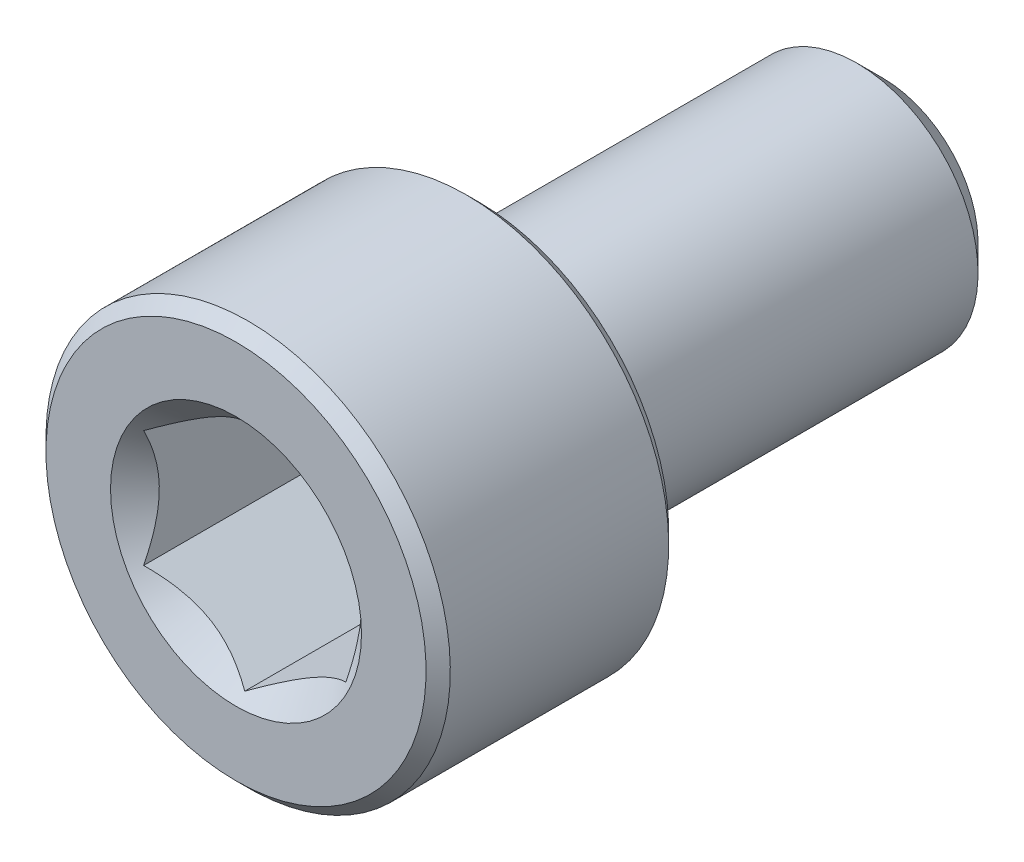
from build123d import *

# Parameters (mm, degrees)
CUT_EXTRUDE1_DEPTH = 5
SKETCH4_R          = 3.103257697
CUT_EXTRUDE2_DEPTH = 3
CUT_EXTRUDE2_DRAFT = -45


with BuildPart() as part:
    # Sketch2 → Revolve1 (revolve)
    with BuildSketch(Plane(origin=(0, 0, 0), x_dir=(0, 0, -1), z_dir=(1, 0, 0))):
        with BuildLine():
            Line((-8, 0), (-8, 4.7))
            Line((-8, 4.7), (-7.7, 5))
            Line((-7.7, 5), (-2.3, 5))
            Line((-2.3, 5), (-2, 4.7))
            Line((-2, 4.7), (-2, 3.3))
            ThreePointArc((-2, 3.3), (-1.912132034, 3.087867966), (-1.7, 3))
            Line((-1.7, 3), (7.350480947, 3))
            Line((7.350480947, 3), (8, 2.350480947))
            Line((8, 2.350480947), (8, 0))
            Line((8, 0), (-8, 0))
        make_face()
    revolve(axis=Axis((0, 0, -8), (0, 0, 1)))

    # Sketch3 → Cut-Extrude1 (cut)
    with BuildSketch(Plane.XY.offset(8)):
        Polygon((2.5, -1.443375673), (2.5, 1.443375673), (0, 2.886751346), (-2.5, 1.443375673), (-2.5, -1.443375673), (0, -2.886751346), align=None)
    extrude(amount=-CUT_EXTRUDE1_DEPTH, mode=Mode.SUBTRACT)


with BuildPart() as cut_extrude2_tool:
    # Sketch4 → Cut-Extrude2 (with draft: the straight prism first)
    with BuildSketch(Plane.XY.offset(8)):
        Circle(SKETCH4_R)
    extrude(amount=-CUT_EXTRUDE2_DEPTH)
    # Cut-Extrude2: the draft: its side faces are tilted about the plane it starts from
    cut_extrude2_sides = [cut_extrude2_tool.faces().sort_by_distance(p)[0] for p in [
        (-3.103257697, 0, 6.5),
    ]]
    draft(cut_extrude2_sides, Plane.XY.offset(8), CUT_EXTRUDE2_DRAFT)


with BuildPart() as part_1:
    add(part.part)

    # Cut-Extrude2: cut by cut_extrude2_tool
    add(cut_extrude2_tool.part, mode=Mode.SUBTRACT)


solid = part_1.part
